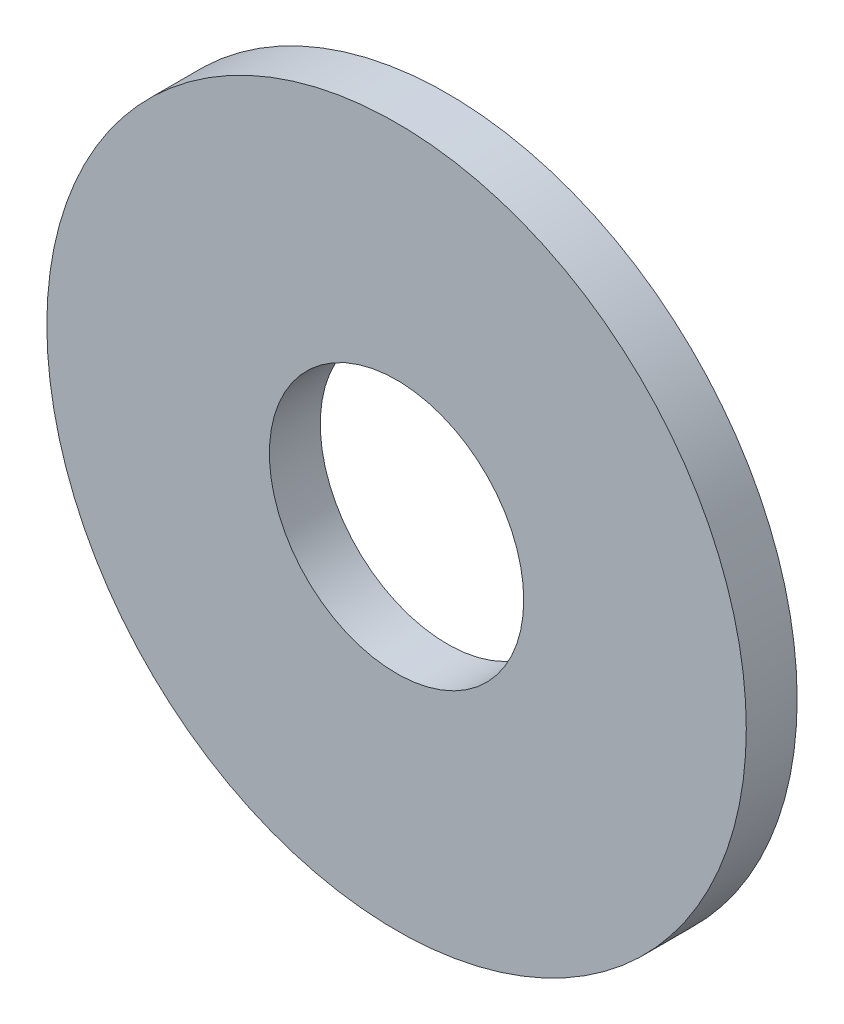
ISO-10303-21;
HEADER;
FILE_DESCRIPTION(('STEP AP214'),'2;1');
FILE_NAME('part.step','',(''),(''),'','','');
FILE_SCHEMA(('AUTOMOTIVE_DESIGN { 1 0 10303 214 1 1 1 1 }'));
ENDSEC;
DATA;
#1=APPLICATION_CONTEXT('core data for automotive mechanical design processes');
#2=APPLICATION_PROTOCOL_DEFINITION('international standard','automotive_design',2000,#1);
#3=PRODUCT_CONTEXT('',#1,'mechanical');
#4=PRODUCT('Part','Part','',(#3));
#5=PRODUCT_RELATED_PRODUCT_CATEGORY('part','',(#4));
#6=PRODUCT_DEFINITION_FORMATION('','',#4);
#7=PRODUCT_DEFINITION_CONTEXT('part definition',#1,'design');
#8=PRODUCT_DEFINITION('design','',#6,#7);
#9=PRODUCT_DEFINITION_SHAPE('','',#8);
#10=(LENGTH_UNIT() NAMED_UNIT(*) SI_UNIT(.MILLI.,.METRE.));
#11=(NAMED_UNIT(*) PLANE_ANGLE_UNIT() SI_UNIT($,.RADIAN.));
#12=(NAMED_UNIT(*) SI_UNIT($,.STERADIAN.) SOLID_ANGLE_UNIT());
#13=UNCERTAINTY_MEASURE_WITH_UNIT(LENGTH_MEASURE(1.E-05),#10,'distance_accuracy_value','');
#14=(GEOMETRIC_REPRESENTATION_CONTEXT(3) GLOBAL_UNCERTAINTY_ASSIGNED_CONTEXT((#13)) GLOBAL_UNIT_ASSIGNED_CONTEXT((#10,
#11,#12)) REPRESENTATION_CONTEXT('',''));
#15=CARTESIAN_POINT('',(0.,0.,0.));
#16=DIRECTION('',(0.,0.,1.));
#17=DIRECTION('',(1.,0.,0.));
#18=AXIS2_PLACEMENT_3D('',#15,#16,#17);
#19=CARTESIAN_POINT('',(0.,0.,4.));
#20=DIRECTION('',(0.,0.,1.));
#21=DIRECTION('',(1.,0.,0.));
#22=AXIS2_PLACEMENT_3D('',#19,#20,#21);
#23=PLANE('',#22);
#24=CARTESIAN_POINT('',(0.,0.,4.));
#25=DIRECTION('',(0.,0.,1.));
#26=DIRECTION('',(1.,0.,0.));
#27=AXIS2_PLACEMENT_3D('',#24,#25,#26);
#28=CIRCLE('',#27,27.5);
#29=CARTESIAN_POINT('',(27.5,0.,4.));
#30=VERTEX_POINT('',#29);
#31=EDGE_CURVE('E10',#30,#30,#28,.T.);
#32=ORIENTED_EDGE('',*,*,#31,.T.);
#33=EDGE_LOOP('',(#32));
#34=FACE_BOUND('',#33,.T.);
#35=CARTESIAN_POINT('',(0.,0.,4.));
#36=DIRECTION('',(0.,0.,1.));
#37=DIRECTION('',(1.,0.,0.));
#38=AXIS2_PLACEMENT_3D('',#35,#36,#37);
#39=CIRCLE('',#38,10.);
#40=CARTESIAN_POINT('',(10.,0.,4.));
#41=VERTEX_POINT('',#40);
#42=EDGE_CURVE('E42',#41,#41,#39,.T.);
#43=ORIENTED_EDGE('',*,*,#42,.F.);
#44=EDGE_LOOP('',(#43));
#45=FACE_BOUND('',#44,.T.);
#46=ADVANCED_FACE('F31',(#34,#45),#23,.T.);
#47=CARTESIAN_POINT('',(0.,0.,0.));
#48=DIRECTION('',(0.,0.,1.));
#49=DIRECTION('',(1.,0.,0.));
#50=AXIS2_PLACEMENT_3D('',#47,#48,#49);
#51=PLANE('',#50);
#52=CARTESIAN_POINT('',(0.,0.,0.));
#53=DIRECTION('',(0.,0.,1.));
#54=DIRECTION('',(1.,0.,0.));
#55=AXIS2_PLACEMENT_3D('',#52,#53,#54);
#56=CIRCLE('',#55,27.5);
#57=CARTESIAN_POINT('',(27.5,0.,0.));
#58=VERTEX_POINT('',#57);
#59=EDGE_CURVE('E35',#58,#58,#56,.T.);
#60=ORIENTED_EDGE('',*,*,#59,.F.);
#61=EDGE_LOOP('',(#60));
#62=FACE_BOUND('',#61,.T.);
#63=CARTESIAN_POINT('',(0.,0.,0.));
#64=DIRECTION('',(0.,0.,1.));
#65=DIRECTION('',(1.,0.,0.));
#66=AXIS2_PLACEMENT_3D('',#63,#64,#65);
#67=CIRCLE('',#66,10.);
#68=CARTESIAN_POINT('',(10.,0.,0.));
#69=VERTEX_POINT('',#68);
#70=EDGE_CURVE('E44',#69,#69,#67,.T.);
#71=ORIENTED_EDGE('',*,*,#70,.T.);
#72=EDGE_LOOP('',(#71));
#73=FACE_BOUND('',#72,.T.);
#74=ADVANCED_FACE('F54',(#62,#73),#51,.F.);
#75=CARTESIAN_POINT('',(0.,0.,4.));
#76=DIRECTION('',(0.,0.,-1.));
#77=DIRECTION('',(-1.,0.,0.));
#78=AXIS2_PLACEMENT_3D('',#75,#76,#77);
#79=CYLINDRICAL_SURFACE('',#78,27.5);
#80=ORIENTED_EDGE('',*,*,#31,.F.);
#81=EDGE_LOOP('',(#80));
#82=FACE_BOUND('',#81,.T.);
#83=ORIENTED_EDGE('',*,*,#59,.T.);
#84=EDGE_LOOP('',(#83));
#85=FACE_BOUND('',#84,.T.);
#86=ADVANCED_FACE('F33',(#82,#85),#79,.T.);
#87=CARTESIAN_POINT('',(0.,0.,4.));
#88=DIRECTION('',(0.,0.,-1.));
#89=DIRECTION('',(-1.,0.,0.));
#90=AXIS2_PLACEMENT_3D('',#87,#88,#89);
#91=CYLINDRICAL_SURFACE('',#90,10.);
#92=ORIENTED_EDGE('',*,*,#42,.T.);
#93=EDGE_LOOP('',(#92));
#94=FACE_BOUND('',#93,.T.);
#95=ORIENTED_EDGE('',*,*,#70,.F.);
#96=EDGE_LOOP('',(#95));
#97=FACE_BOUND('',#96,.T.);
#98=ADVANCED_FACE('F50',(#94,#97),#91,.F.);
#99=CLOSED_SHELL('',(#46,#74,#86,#98));
#100=MANIFOLD_SOLID_BREP('B2',#99);
#101=ADVANCED_BREP_SHAPE_REPRESENTATION('',(#18,#100),#14);
#102=SHAPE_DEFINITION_REPRESENTATION(#9,#101);
ENDSEC;
END-ISO-10303-21;
